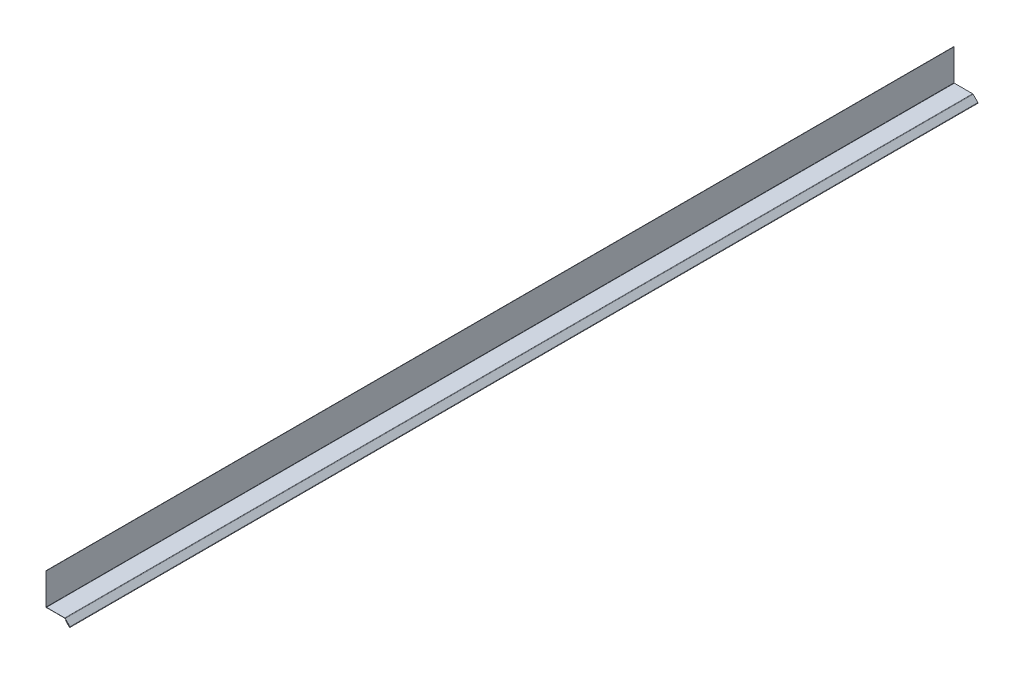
from build123d import *

# Parameters (mm, degrees)
EXTRUDE_THIN1_DEPTH = 2000


with BuildPart() as part:
    # Sketch1 → Extrude-Thin1 (new body)
    with BuildSketch(Plane.XY):
        with BuildLine():
            Line((43.531377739, -3.249750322), (51.798870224, -11.517242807))
            ThreePointArc((51.798870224, -11.517242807), (52.505977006, -11.517242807), (52.505977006, -10.810136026))
            Line((52.505977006, -10.810136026), (41.99342049, -0.29757951))
            ThreePointArc((41.99342049, -0.29757951), (41.663806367, -0.077338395), (41.275, 0))
            Line((41.275, 0), (1, 0))
            ThreePointArc((1, 0), (0.292893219, 0.292893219), (0, 1))
            Line((0, 1), (0, 69.85))
            Line((0, 69.85), (0.508, 69.85))
            Line((0.508, 69.85), (0.508, 1))
            ThreePointArc((0.508, 1), (0.652103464, 0.652103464), (1, 0.508))
            Line((1, 0.508), (41.275, 0.508))
            ThreePointArc((41.275, 0.508), (41.858209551, 0.391992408), (42.352630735, 0.061630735))
            Line((42.352630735, 0.061630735), (52.86518725, -10.450925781))
            ThreePointArc((52.86518725, -10.450925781), (52.86518725, -11.876453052), (51.43965998, -11.876453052))
            Line((51.43965998, -11.876453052), (43.172167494, -3.608960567))
            Line((43.172167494, -3.608960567), (43.531377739, -3.249750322))
        make_face()
    extrude(amount=EXTRUDE_THIN1_DEPTH)


solid = part.part
